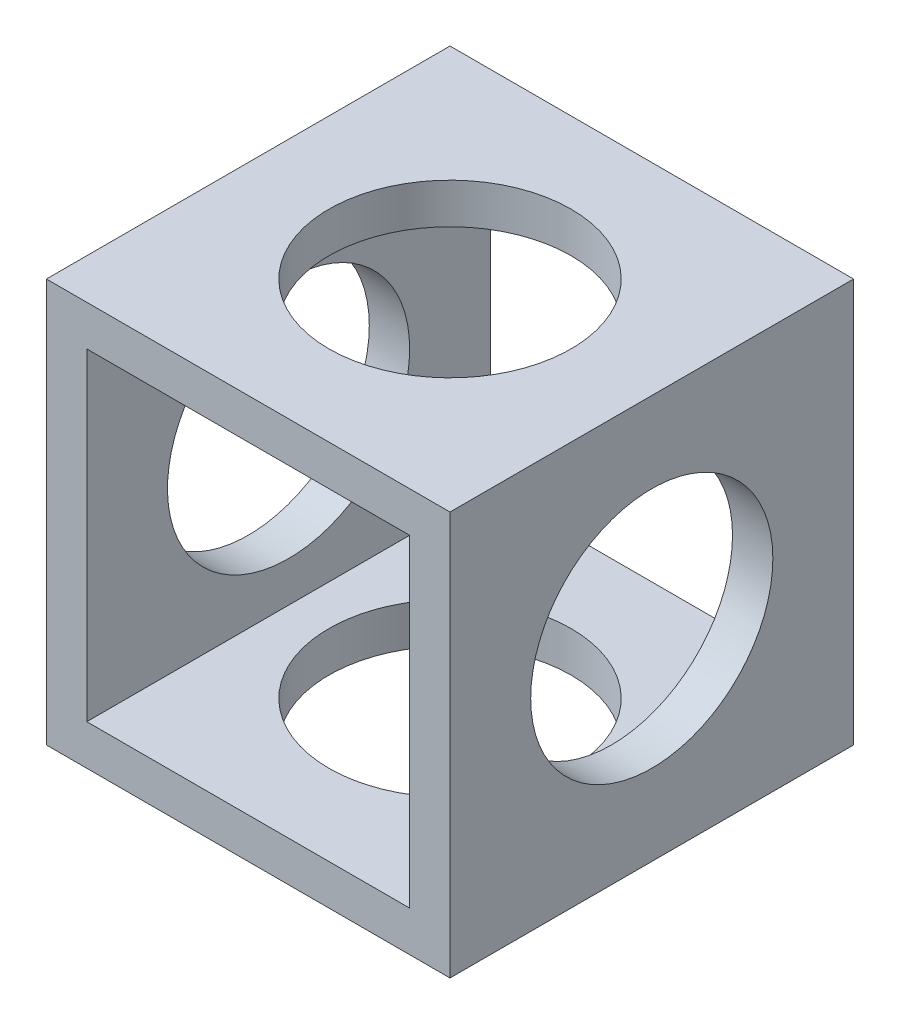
from build123d import *

# Parameters (mm, degrees)
CROQUIS1_W              = 50
CROQUIS1_H              = 50
CROQUIS1_W_2            = 40
CROQUIS1_H_2            = 40
SALIENTE_EXTRUIR1_DEPTH = 25
TALADRO1_D              = 30
TALADRO3_D              = 30
TALADRO3_DEPTH          = 5
TALADRO4_D              = 30


with BuildPart() as part:
    # Croquis1 → Saliente-Extruir1 (new, symmetric)
    with BuildSketch(Plane.XY):
        Rectangle(CROQUIS1_W, CROQUIS1_H)
        Rectangle(CROQUIS1_W_2, CROQUIS1_H_2, mode=Mode.SUBTRACT)
    extrude(amount=SALIENTE_EXTRUIR1_DEPTH, both=True)

    # Taladro1 (through all)
    with Locations(Plane(origin=(25, 0, 0), x_dir=(0, 0, -1), z_dir=(1, 0, 0))):
        with Locations((0, 0)):
            Hole(TALADRO1_D / 2)

    # Taladro3
    with Locations(Plane(origin=(0, -20, 0), x_dir=(1, 0, 0), z_dir=(0, 1, 0))):
        with Locations((0, 0)):
            Hole(TALADRO3_D / 2, depth=TALADRO3_DEPTH)

    # Taladro4 (through all)
    with Locations(Plane(origin=(0, 25, 0), x_dir=(1, 0, 0), z_dir=(0, 1, 0))):
        with Locations((0, 0)):
            Hole(TALADRO4_D / 2)


solid = part.part
